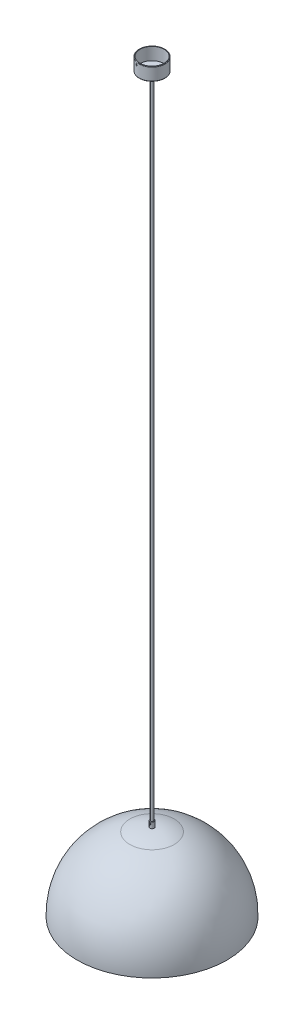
ISO-10303-21;
HEADER;
FILE_DESCRIPTION(('STEP AP214'),'2;1');
FILE_NAME('part.step','',(''),(''),'','','');
FILE_SCHEMA(('AUTOMOTIVE_DESIGN { 1 0 10303 214 1 1 1 1 }'));
ENDSEC;
DATA;
#1=APPLICATION_CONTEXT('core data for automotive mechanical design processes');
#2=APPLICATION_PROTOCOL_DEFINITION('international standard','automotive_design',2000,#1);
#3=PRODUCT_CONTEXT('',#1,'mechanical');
#4=PRODUCT('Part','Part','',(#3));
#5=PRODUCT_RELATED_PRODUCT_CATEGORY('part','',(#4));
#6=PRODUCT_DEFINITION_FORMATION('','',#4);
#7=PRODUCT_DEFINITION_CONTEXT('part definition',#1,'design');
#8=PRODUCT_DEFINITION('design','',#6,#7);
#9=PRODUCT_DEFINITION_SHAPE('','',#8);
#10=(LENGTH_UNIT() NAMED_UNIT(*) SI_UNIT(.MILLI.,.METRE.));
#11=(NAMED_UNIT(*) PLANE_ANGLE_UNIT() SI_UNIT($,.RADIAN.));
#12=(NAMED_UNIT(*) SI_UNIT($,.STERADIAN.) SOLID_ANGLE_UNIT());
#13=UNCERTAINTY_MEASURE_WITH_UNIT(LENGTH_MEASURE(1.E-05),#10,'distance_accuracy_value','');
#14=(GEOMETRIC_REPRESENTATION_CONTEXT(3) GLOBAL_UNCERTAINTY_ASSIGNED_CONTEXT((#13)) GLOBAL_UNIT_ASSIGNED_CONTEXT((#10,
#11,#12)) REPRESENTATION_CONTEXT('',''));
#15=CARTESIAN_POINT('',(0.,0.,0.));
#16=DIRECTION('',(0.,0.,1.));
#17=DIRECTION('',(1.,0.,0.));
#18=AXIS2_PLACEMENT_3D('',#15,#16,#17);
#19=CARTESIAN_POINT('',(-1.70945543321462,1578.98089947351,350.138888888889));
#20=DIRECTION('',(0.,1.,0.));
#21=DIRECTION('',(0.254766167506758,0.,-0.967002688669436));
#22=AXIS2_PLACEMENT_3D('',#19,#20,#21);
#23=CYLINDRICAL_SURFACE('',#22,5.);
#24=CARTESIAN_POINT('',(-1.70945543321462,1578.98089947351,350.138888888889));
#25=DIRECTION('',(0.,-1.,0.));
#26=DIRECTION('',(-0.254766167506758,0.,0.967002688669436));
#27=AXIS2_PLACEMENT_3D('',#24,#25,#26);
#28=CIRCLE('',#27,5.);
#29=CARTESIAN_POINT('',(-2.98328627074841,1578.98089947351,354.973902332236));
#30=VERTEX_POINT('',#29);
#31=EDGE_CURVE('P0_E21',#30,#30,#28,.T.);
#32=ORIENTED_EDGE('',*,*,#31,.F.);
#33=EDGE_LOOP('',(#32));
#34=FACE_BOUND('',#33,.T.);
#35=CARTESIAN_POINT('',(-1.70945543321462,1593.98089947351,350.138888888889));
#36=DIRECTION('',(0.,-1.,0.));
#37=DIRECTION('',(-0.254766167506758,0.,0.967002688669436));
#38=AXIS2_PLACEMENT_3D('',#35,#36,#37);
#39=CIRCLE('',#38,5.);
#40=CARTESIAN_POINT('',(-2.98328627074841,1593.98089947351,354.973902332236));
#41=VERTEX_POINT('',#40);
#42=EDGE_CURVE('P0_E17',#41,#41,#39,.T.);
#43=ORIENTED_EDGE('',*,*,#42,.T.);
#44=EDGE_LOOP('',(#43));
#45=FACE_BOUND('',#44,.T.);
#46=ADVANCED_FACE('P0_F14',(#34,#45),#23,.T.);
#47=CARTESIAN_POINT('',(-1.70945543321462,1578.98089947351,350.138888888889));
#48=DIRECTION('',(0.,-1.,0.));
#49=DIRECTION('',(-0.254766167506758,0.,0.967002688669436));
#50=AXIS2_PLACEMENT_3D('',#47,#48,#49);
#51=PLANE('',#50);
#52=CARTESIAN_POINT('',(-1.70945543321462,1578.98089947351,350.138888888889));
#53=DIRECTION('',(0.,-1.,0.));
#54=DIRECTION('',(-0.254766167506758,0.,0.967002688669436));
#55=AXIS2_PLACEMENT_3D('',#52,#53,#54);
#56=CIRCLE('',#55,3.);
#57=CARTESIAN_POINT('',(-2.4737539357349,1578.98089947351,353.039896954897));
#58=VERTEX_POINT('',#57);
#59=EDGE_CURVE('P0_E9',#58,#58,#56,.T.);
#60=ORIENTED_EDGE('',*,*,#59,.F.);
#61=EDGE_LOOP('',(#60));
#62=FACE_BOUND('',#61,.T.);
#63=ORIENTED_EDGE('',*,*,#31,.T.);
#64=EDGE_LOOP('',(#63));
#65=FACE_BOUND('',#64,.T.);
#66=ADVANCED_FACE('P0_F38',(#62,#65),#51,.T.);
#67=CARTESIAN_POINT('',(-1.70945543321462,1593.98089947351,350.138888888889));
#68=DIRECTION('',(0.,-1.,0.));
#69=DIRECTION('',(-0.254766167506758,0.,0.967002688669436));
#70=AXIS2_PLACEMENT_3D('',#67,#68,#69);
#71=PLANE('',#70);
#72=ORIENTED_EDGE('',*,*,#42,.F.);
#73=EDGE_LOOP('',(#72));
#74=FACE_BOUND('',#73,.T.);
#75=ADVANCED_FACE('P0_F35',(#74),#71,.F.);
#76=CARTESIAN_POINT('',(-1.70945543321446,78.9808994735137,350.138888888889));
#77=DIRECTION('',(0.,1.,0.));
#78=DIRECTION('',(0.254766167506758,0.,-0.967002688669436));
#79=AXIS2_PLACEMENT_3D('',#76,#77,#78);
#80=CYLINDRICAL_SURFACE('',#79,3.);
#81=CARTESIAN_POINT('',(-1.70945543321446,78.9808994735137,350.138888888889));
#82=DIRECTION('',(0.,-1.,0.));
#83=DIRECTION('',(-0.254766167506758,0.,0.967002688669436));
#84=AXIS2_PLACEMENT_3D('',#81,#82,#83);
#85=CIRCLE('',#84,3.);
#86=CARTESIAN_POINT('',(-2.47375393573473,78.9808994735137,353.039896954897));
#87=VERTEX_POINT('',#86);
#88=EDGE_CURVE('P0_E27',#87,#87,#85,.T.);
#89=ORIENTED_EDGE('',*,*,#88,.F.);
#90=EDGE_LOOP('',(#89));
#91=FACE_BOUND('',#90,.T.);
#92=ORIENTED_EDGE('',*,*,#59,.T.);
#93=EDGE_LOOP('',(#92));
#94=FACE_BOUND('',#93,.T.);
#95=ADVANCED_FACE('P0_F37',(#91,#94),#80,.T.);
#96=CARTESIAN_POINT('',(-1.70945543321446,78.9808994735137,350.138888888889));
#97=DIRECTION('',(0.,-1.,0.));
#98=DIRECTION('',(-0.254766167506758,0.,0.967002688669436));
#99=AXIS2_PLACEMENT_3D('',#96,#97,#98);
#100=PLANE('',#99);
#101=ORIENTED_EDGE('',*,*,#88,.T.);
#102=EDGE_LOOP('',(#101));
#103=FACE_BOUND('',#102,.T.);
#104=ADVANCED_FACE('P0_F44',(#103),#100,.T.);
#105=CLOSED_SHELL('',(#46,#66,#75,#95,#104));
#106=MANIFOLD_SOLID_BREP('P0_B1',#105);
#107=CARTESIAN_POINT('',(5.93352959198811,1617.19767740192,321.128808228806));
#108=DIRECTION('',(-0.254766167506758,0.,0.967002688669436));
#109=DIRECTION('',(-0.967002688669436,0.,-0.254766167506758));
#110=AXIS2_PLACEMENT_3D('',#107,#108,#109);
#111=CONICAL_SURFACE('',#110,2.16156164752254,0.767944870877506);
#112=CARTESIAN_POINT('',(5.98312195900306,1617.19767740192,320.9405730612));
#113=DIRECTION('',(0.254766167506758,0.,-0.967002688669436));
#114=DIRECTION('',(0.967002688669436,0.,0.254766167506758));
#115=AXIS2_PLACEMENT_3D('',#112,#113,#114);
#116=CIRCLE('',#115,1.97358224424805);
#117=CARTESIAN_POINT('',(4.07466262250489,1617.19767740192,320.437771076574));
#118=VERTEX_POINT('',#117);
#119=EDGE_CURVE('P1_E10',#118,#118,#116,.T.);
#120=CARTESIAN_POINT('',(5.93352959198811,1617.19767740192,321.128808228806));
#121=DIRECTION('',(-0.254766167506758,0.,0.967002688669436));
#122=DIRECTION('',(-0.967002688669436,0.,-0.254766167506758));
#123=AXIS2_PLACEMENT_3D('',#120,#121,#122);
#124=CIRCLE('',#123,2.16156164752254);
#125=CARTESIAN_POINT('',(3.84329366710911,1617.19767740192,320.578115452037));
#126=VERTEX_POINT('',#125);
#127=EDGE_CURVE('P1_E26',#126,#126,#124,.T.);
#128=CARTESIAN_POINT('',(4.07466262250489,1617.19767740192,320.437771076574));
#129=CARTESIAN_POINT('',(4.07225252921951,1617.19767740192,320.439232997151));
#130=CARTESIAN_POINT('',(4.06984243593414,1617.19767740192,320.440694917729));
#131=CARTESIAN_POINT('',(4.0650222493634,1617.19767740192,320.443618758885));
#132=CARTESIAN_POINT('',(4.06261215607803,1617.19767740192,320.445080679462));
#133=CARTESIAN_POINT('',(4.05779196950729,1617.19767740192,320.448004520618));
#134=CARTESIAN_POINT('',(4.05538187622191,1617.19767740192,320.449466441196));
#135=CARTESIAN_POINT('',(4.05056168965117,1617.19767740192,320.452390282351));
#136=CARTESIAN_POINT('',(4.04815159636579,1617.19767740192,320.453852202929));
#137=CARTESIAN_POINT('',(4.04333140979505,1617.19767740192,320.456776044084));
#138=CARTESIAN_POINT('',(4.04092131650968,1617.19767740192,320.458237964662));
#139=CARTESIAN_POINT('',(4.03610112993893,1617.19767740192,320.461161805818));
#140=CARTESIAN_POINT('',(4.03369103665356,1617.19767740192,320.462623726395));
#141=CARTESIAN_POINT('',(4.02887085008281,1617.19767740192,320.465547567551));
#142=CARTESIAN_POINT('',(4.02646075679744,1617.19767740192,320.467009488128));
#143=CARTESIAN_POINT('',(4.02164057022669,1617.19767740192,320.469933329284));
#144=CARTESIAN_POINT('',(4.01923047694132,1617.19767740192,320.471395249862));
#145=CARTESIAN_POINT('',(4.01441029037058,1617.19767740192,320.474319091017));
#146=CARTESIAN_POINT('',(4.0120001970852,1617.19767740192,320.475781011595));
#147=CARTESIAN_POINT('',(4.00718001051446,1617.19767740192,320.47870485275));
#148=CARTESIAN_POINT('',(4.00476991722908,1617.19767740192,320.480166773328));
#149=CARTESIAN_POINT('',(3.99994973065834,1617.19767740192,320.483090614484));
#150=CARTESIAN_POINT('',(3.99753963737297,1617.19767740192,320.484552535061));
#151=CARTESIAN_POINT('',(3.99271945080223,1617.19767740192,320.487476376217));
#152=CARTESIAN_POINT('',(3.99030935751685,1617.19767740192,320.488938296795));
#153=CARTESIAN_POINT('',(3.9854891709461,1617.19767740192,320.49186213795));
#154=CARTESIAN_POINT('',(3.98307907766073,1617.19767740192,320.493324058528));
#155=CARTESIAN_POINT('',(3.97825889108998,1617.19767740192,320.496247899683));
#156=CARTESIAN_POINT('',(3.97584879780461,1617.19767740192,320.497709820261));
#157=CARTESIAN_POINT('',(3.97102861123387,1617.19767740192,320.500633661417));
#158=CARTESIAN_POINT('',(3.9686185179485,1617.19767740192,320.502095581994));
#159=CARTESIAN_POINT('',(3.96379833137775,1617.19767740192,320.50501942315));
#160=CARTESIAN_POINT('',(3.96138823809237,1617.19767740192,320.506481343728));
#161=CARTESIAN_POINT('',(3.95656805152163,1617.19767740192,320.509405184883));
#162=CARTESIAN_POINT('',(3.95415795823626,1617.19767740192,320.510867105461));
#163=CARTESIAN_POINT('',(3.94933777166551,1617.19767740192,320.513790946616));
#164=CARTESIAN_POINT('',(3.94692767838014,1617.19767740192,320.515252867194));
#165=CARTESIAN_POINT('',(3.94210749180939,1617.19767740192,320.51817670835));
#166=CARTESIAN_POINT('',(3.93969739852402,1617.19767740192,320.519638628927));
#167=CARTESIAN_POINT('',(3.93487721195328,1617.19767740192,320.522562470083));
#168=CARTESIAN_POINT('',(3.9324671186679,1617.19767740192,320.52402439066));
#169=CARTESIAN_POINT('',(3.92764693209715,1617.19767740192,320.526948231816));
#170=CARTESIAN_POINT('',(3.92523683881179,1617.19767740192,320.528410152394));
#171=CARTESIAN_POINT('',(3.92041665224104,1617.19767740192,320.531333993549));
#172=CARTESIAN_POINT('',(3.91800655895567,1617.19767740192,320.532795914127));
#173=CARTESIAN_POINT('',(3.91318637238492,1617.19767740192,320.535719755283));
#174=CARTESIAN_POINT('',(3.91077627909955,1617.19767740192,320.53718167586));
#175=CARTESIAN_POINT('',(3.9059560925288,1617.19767740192,320.540105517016));
#176=CARTESIAN_POINT('',(3.90354599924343,1617.19767740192,320.541567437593));
#177=CARTESIAN_POINT('',(3.89872581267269,1617.19767740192,320.544491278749));
#178=CARTESIAN_POINT('',(3.89631571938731,1617.19767740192,320.545953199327));
#179=CARTESIAN_POINT('',(3.89149553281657,1617.19767740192,320.548877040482));
#180=CARTESIAN_POINT('',(3.88908543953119,1617.19767740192,320.55033896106));
#181=CARTESIAN_POINT('',(3.88426525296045,1617.19767740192,320.553262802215));
#182=CARTESIAN_POINT('',(3.88185515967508,1617.19767740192,320.554724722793));
#183=CARTESIAN_POINT('',(3.87703497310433,1617.19767740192,320.557648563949));
#184=CARTESIAN_POINT('',(3.87462487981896,1617.19767740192,320.559110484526));
#185=CARTESIAN_POINT('',(3.86980469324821,1617.19767740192,320.562034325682));
#186=CARTESIAN_POINT('',(3.86739459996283,1617.19767740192,320.56349624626));
#187=CARTESIAN_POINT('',(3.86257441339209,1617.19767740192,320.566420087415));
#188=CARTESIAN_POINT('',(3.86016432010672,1617.19767740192,320.567882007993));
#189=CARTESIAN_POINT('',(3.85534413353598,1617.19767740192,320.570805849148));
#190=CARTESIAN_POINT('',(3.85293404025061,1617.19767740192,320.572267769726));
#191=CARTESIAN_POINT('',(3.84811385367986,1617.19767740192,320.575191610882));
#192=CARTESIAN_POINT('',(3.84570376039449,1617.19767740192,320.576653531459));
#193=CARTESIAN_POINT('',(3.84329366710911,1617.19767740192,320.578115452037));
#194=B_SPLINE_CURVE_WITH_KNOTS('',3,(#128,#129,#130,#131,#132,#133,#134,#135,#136,#137,#138,
#139,#140,#141,#142,#143,#144,#145,#146,#147,#148,#149,#150,#151,#152,#153,#154,#155,#156,#157,
#158,#159,#160,#161,#162,#163,#164,#165,#166,#167,#168,#169,#170,#171,#172,#173,#174,#175,#176,
#177,#178,#179,#180,#181,#182,#183,#184,#185,#186,#187,#188,#189,#190,#191,#192,#193),
.UNSPECIFIED.,.F.,.F.,(4,2,2,2,2,2,2,2,2,2,2,2,2,2,2,2,2,2,2,2,2,2,2,2,2,2,2,2,2,2,2,2,4),(0.,
0.00845646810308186,0.0169129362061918,0.0253694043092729,0.0338258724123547,0.0422823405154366,
0.050738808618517,0.0591952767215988,0.0676517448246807,0.076108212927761,0.0845646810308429,
0.0930211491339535,0.101477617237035,0.109934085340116,0.118390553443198,0.126847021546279,
0.135303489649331,0.143759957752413,0.152216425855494,0.160672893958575,0.169129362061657,
0.177585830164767,0.186042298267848,0.19449876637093,0.202955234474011,0.211411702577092,
0.219868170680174,0.228324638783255,0.236781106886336,0.245237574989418,0.253694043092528,
0.262150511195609,0.270606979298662),.UNSPECIFIED.);
#195=EDGE_CURVE('P1_BSEAM15',#118,#126,#194,.T.);
#196=ORIENTED_EDGE('',*,*,#119,.F.);
#197=ORIENTED_EDGE('',*,*,#127,.F.);
#198=ORIENTED_EDGE('',*,*,#195,.T.);
#199=ORIENTED_EDGE('',*,*,#195,.F.);
#200=EDGE_LOOP('',(#196,#198,#197,#199));
#201=FACE_BOUND('',#200,.T.);
#202=ADVANCED_FACE('P1_F15',(#201),#111,.T.);
#203=CARTESIAN_POINT('',(6.06091267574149,1617.19767740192,320.645306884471));
#204=DIRECTION('',(0.254766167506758,0.,-0.967002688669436));
#205=DIRECTION('',(-0.967002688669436,0.,-0.254766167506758));
#206=AXIS2_PLACEMENT_3D('',#203,#204,#205);
#207=PLANE('',#206);
#208=CARTESIAN_POINT('',(6.06091267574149,1617.19767740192,320.645306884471));
#209=DIRECTION('',(-0.254766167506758,0.,0.967002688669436));
#210=DIRECTION('',(-0.967002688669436,0.,-0.254766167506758));
#211=AXIS2_PLACEMENT_3D('',#208,#209,#210);
#212=CIRCLE('',#211,1.2542424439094);
#213=CARTESIAN_POINT('',(4.84805686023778,1617.19767740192,320.325768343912));
#214=VERTEX_POINT('',#213);
#215=EDGE_CURVE('P1_E22',#214,#214,#212,.T.);
#216=ORIENTED_EDGE('',*,*,#215,.F.);
#217=EDGE_LOOP('',(#216));
#218=FACE_BOUND('',#217,.T.);
#219=ADVANCED_FACE('P1_F36',(#218),#207,.T.);
#220=CARTESIAN_POINT('',(5.93352959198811,1617.19767740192,321.128808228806));
#221=DIRECTION('',(0.254766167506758,0.,-0.967002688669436));
#222=DIRECTION('',(-0.967002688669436,0.,-0.254766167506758));
#223=AXIS2_PLACEMENT_3D('',#220,#221,#222);
#224=PLANE('',#223);
#225=ORIENTED_EDGE('',*,*,#127,.T.);
#226=EDGE_LOOP('',(#225));
#227=FACE_BOUND('',#226,.T.);
#228=ADVANCED_FACE('P1_F33',(#227),#224,.F.);
#229=CARTESIAN_POINT('',(5.80614650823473,1617.19767740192,321.612309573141));
#230=DIRECTION('',(0.254766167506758,0.,-0.967002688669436));
#231=DIRECTION('',(-0.967002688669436,0.,-0.254766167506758));
#232=AXIS2_PLACEMENT_3D('',#229,#230,#231);
#233=TOROIDAL_SURFACE('',#232,1.2542424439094,1.);
#234=ORIENTED_EDGE('',*,*,#119,.T.);
#235=EDGE_LOOP('',(#234));
#236=FACE_BOUND('',#235,.T.);
#237=ORIENTED_EDGE('',*,*,#215,.T.);
#238=EDGE_LOOP('',(#237));
#239=FACE_BOUND('',#238,.T.);
#240=ADVANCED_FACE('P1_F17',(#236,#239),#233,.T.);
#241=CLOSED_SHELL('',(#202,#219,#228,#240));
#242=MANIFOLD_SOLID_BREP('P1_B1',#241);
#243=CARTESIAN_POINT('',(-9.35244045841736,1617.19767740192,379.148969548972));
#244=DIRECTION('',(0.254766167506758,0.,-0.967002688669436));
#245=DIRECTION('',(-0.967002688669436,0.,-0.254766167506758));
#246=AXIS2_PLACEMENT_3D('',#243,#244,#245);
#247=CONICAL_SURFACE('',#246,2.16156164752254,0.767944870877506);
#248=CARTESIAN_POINT('',(-9.40203282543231,1617.19767740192,379.337204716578));
#249=DIRECTION('',(0.254766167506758,0.,-0.967002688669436));
#250=DIRECTION('',(0.967002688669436,0.,0.254766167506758));
#251=AXIS2_PLACEMENT_3D('',#248,#249,#250);
#252=CIRCLE('',#251,1.97358224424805);
#253=CARTESIAN_POINT('',(-11.3104921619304,1617.19767740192,378.834402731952));
#254=VERTEX_POINT('',#253);
#255=EDGE_CURVE('P2_E10',#254,#254,#252,.T.);
#256=CARTESIAN_POINT('',(-9.35244045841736,1617.19767740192,379.148969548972));
#257=DIRECTION('',(-0.254766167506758,0.,0.967002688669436));
#258=DIRECTION('',(-0.967002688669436,0.,-0.254766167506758));
#259=AXIS2_PLACEMENT_3D('',#256,#257,#258);
#260=CIRCLE('',#259,2.16156164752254);
#261=CARTESIAN_POINT('',(-11.4426763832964,1617.19767740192,378.598276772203));
#262=VERTEX_POINT('',#261);
#263=EDGE_CURVE('P2_E26',#262,#262,#260,.T.);
#264=CARTESIAN_POINT('',(-11.3104921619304,1617.19767740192,378.834402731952));
#265=CARTESIAN_POINT('',(-11.311869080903,1617.19767740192,378.831943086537));
#266=CARTESIAN_POINT('',(-11.3132459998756,1617.19767740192,378.829483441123));
#267=CARTESIAN_POINT('',(-11.3159998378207,1617.19767740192,378.824564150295));
#268=CARTESIAN_POINT('',(-11.3173767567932,1617.19767740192,378.822104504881));
#269=CARTESIAN_POINT('',(-11.3201305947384,1617.19767740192,378.817185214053));
#270=CARTESIAN_POINT('',(-11.3215075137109,1617.19767740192,378.814725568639));
#271=CARTESIAN_POINT('',(-11.3242613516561,1617.19767740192,378.809806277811));
#272=CARTESIAN_POINT('',(-11.3256382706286,1617.19767740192,378.807346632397));
#273=CARTESIAN_POINT('',(-11.3283921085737,1617.19767740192,378.802427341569));
#274=CARTESIAN_POINT('',(-11.3297690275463,1617.19767740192,378.799967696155));
#275=CARTESIAN_POINT('',(-11.3325228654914,1617.19767740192,378.795048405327));
#276=CARTESIAN_POINT('',(-11.333899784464,1617.19767740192,378.792588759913));
#277=CARTESIAN_POINT('',(-11.3366536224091,1617.19767740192,378.787669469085));
#278=CARTESIAN_POINT('',(-11.3380305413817,1617.19767740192,378.785209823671));
#279=CARTESIAN_POINT('',(-11.3407843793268,1617.19767740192,378.780290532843));
#280=CARTESIAN_POINT('',(-11.3421612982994,1617.19767740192,378.777830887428));
#281=CARTESIAN_POINT('',(-11.3449151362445,1617.19767740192,378.7729115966));
#282=CARTESIAN_POINT('',(-11.3462920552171,1617.19767740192,378.770451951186));
#283=CARTESIAN_POINT('',(-11.3490458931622,1617.19767740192,378.765532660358));
#284=CARTESIAN_POINT('',(-11.3504228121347,1617.19767740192,378.763073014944));
#285=CARTESIAN_POINT('',(-11.3531766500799,1617.19767740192,378.758153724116));
#286=CARTESIAN_POINT('',(-11.3545535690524,1617.19767740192,378.755694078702));
#287=CARTESIAN_POINT('',(-11.3573074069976,1617.19767740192,378.750774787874));
#288=CARTESIAN_POINT('',(-11.3586843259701,1617.19767740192,378.74831514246));
#289=CARTESIAN_POINT('',(-11.3614381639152,1617.19767740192,378.743395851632));
#290=CARTESIAN_POINT('',(-11.3628150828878,1617.19767740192,378.740936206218));
#291=CARTESIAN_POINT('',(-11.3655689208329,1617.19767740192,378.73601691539));
#292=CARTESIAN_POINT('',(-11.3669458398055,1617.19767740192,378.733557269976));
#293=CARTESIAN_POINT('',(-11.3696996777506,1617.19767740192,378.728637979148));
#294=CARTESIAN_POINT('',(-11.3710765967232,1617.19767740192,378.726178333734));
#295=CARTESIAN_POINT('',(-11.3738304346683,1617.19767740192,378.721259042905));
#296=CARTESIAN_POINT('',(-11.3752073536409,1617.19767740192,378.718799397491));
#297=CARTESIAN_POINT('',(-11.377961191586,1617.19767740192,378.713880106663));
#298=CARTESIAN_POINT('',(-11.3793381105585,1617.19767740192,378.711420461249));
#299=CARTESIAN_POINT('',(-11.3820919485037,1617.19767740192,378.706501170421));
#300=CARTESIAN_POINT('',(-11.3834688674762,1617.19767740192,378.704041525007));
#301=CARTESIAN_POINT('',(-11.3862227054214,1617.19767740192,378.699122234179));
#302=CARTESIAN_POINT('',(-11.3875996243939,1617.19767740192,378.696662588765));
#303=CARTESIAN_POINT('',(-11.390353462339,1617.19767740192,378.691743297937));
#304=CARTESIAN_POINT('',(-11.3917303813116,1617.19767740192,378.689283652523));
#305=CARTESIAN_POINT('',(-11.3944842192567,1617.19767740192,378.684364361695));
#306=CARTESIAN_POINT('',(-11.3958611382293,1617.19767740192,378.681904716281));
#307=CARTESIAN_POINT('',(-11.3986149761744,1617.19767740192,378.676985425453));
#308=CARTESIAN_POINT('',(-11.399991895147,1617.19767740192,378.674525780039));
#309=CARTESIAN_POINT('',(-11.4027457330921,1617.19767740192,378.66960648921));
#310=CARTESIAN_POINT('',(-11.4041226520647,1617.19767740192,378.667146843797));
#311=CARTESIAN_POINT('',(-11.4068764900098,1617.19767740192,378.662227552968));
#312=CARTESIAN_POINT('',(-11.4082534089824,1617.19767740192,378.659767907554));
#313=CARTESIAN_POINT('',(-11.4110072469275,1617.19767740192,378.654848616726));
#314=CARTESIAN_POINT('',(-11.4123841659,1617.19767740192,378.652388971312));
#315=CARTESIAN_POINT('',(-11.4151380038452,1617.19767740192,378.647469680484));
#316=CARTESIAN_POINT('',(-11.4165149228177,1617.19767740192,378.64501003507));
#317=CARTESIAN_POINT('',(-11.4192687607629,1617.19767740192,378.640090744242));
#318=CARTESIAN_POINT('',(-11.4206456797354,1617.19767740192,378.637631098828));
#319=CARTESIAN_POINT('',(-11.4233995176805,1617.19767740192,378.632711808));
#320=CARTESIAN_POINT('',(-11.4247764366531,1617.19767740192,378.630252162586));
#321=CARTESIAN_POINT('',(-11.4275302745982,1617.19767740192,378.625332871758));
#322=CARTESIAN_POINT('',(-11.4289071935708,1617.19767740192,378.622873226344));
#323=CARTESIAN_POINT('',(-11.4316610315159,1617.19767740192,378.617953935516));
#324=CARTESIAN_POINT('',(-11.4330379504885,1617.19767740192,378.615494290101));
#325=CARTESIAN_POINT('',(-11.4357917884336,1617.19767740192,378.610574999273));
#326=CARTESIAN_POINT('',(-11.4371687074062,1617.19767740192,378.608115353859));
#327=CARTESIAN_POINT('',(-11.4399225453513,1617.19767740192,378.603196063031));
#328=CARTESIAN_POINT('',(-11.4412994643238,1617.19767740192,378.600736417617));
#329=CARTESIAN_POINT('',(-11.4426763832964,1617.19767740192,378.598276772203));
#330=B_SPLINE_CURVE_WITH_KNOTS('',3,(#264,#265,#266,#267,#268,#269,#270,#271,#272,#273,#274,
#275,#276,#277,#278,#279,#280,#281,#282,#283,#284,#285,#286,#287,#288,#289,#290,#291,#292,#293,
#294,#295,#296,#297,#298,#299,#300,#301,#302,#303,#304,#305,#306,#307,#308,#309,#310,#311,#312,
#313,#314,#315,#316,#317,#318,#319,#320,#321,#322,#323,#324,#325,#326,#327,#328,#329),
.UNSPECIFIED.,.F.,.F.,(4,2,2,2,2,2,2,2,2,2,2,2,2,2,2,2,2,2,2,2,2,2,2,2,2,2,2,2,2,2,2,2,4),(0.,
0.00845646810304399,0.0169129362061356,0.025369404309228,0.0338258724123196,0.0422823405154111,
0.0507388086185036,0.0591952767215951,0.0676517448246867,0.0761082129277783,0.0845646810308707,
0.0930211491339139,0.101477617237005,0.109934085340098,0.118390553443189,0.126847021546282,
0.135303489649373,0.143759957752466,0.152216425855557,0.16067289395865,0.169129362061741,
0.177585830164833,0.186042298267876,0.194498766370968,0.20295523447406,0.211411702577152,
0.219868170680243,0.228324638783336,0.236781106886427,0.24523757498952,0.253694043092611,
0.262150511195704,0.270606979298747),.UNSPECIFIED.);
#331=EDGE_CURVE('P2_BSEAM15',#254,#262,#330,.T.);
#332=ORIENTED_EDGE('',*,*,#255,.T.);
#333=ORIENTED_EDGE('',*,*,#263,.T.);
#334=ORIENTED_EDGE('',*,*,#331,.T.);
#335=ORIENTED_EDGE('',*,*,#331,.F.);
#336=EDGE_LOOP('',(#332,#334,#333,#335));
#337=FACE_BOUND('',#336,.T.);
#338=ADVANCED_FACE('P2_F15',(#337),#247,.T.);
#339=CARTESIAN_POINT('',(-9.47982354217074,1617.19767740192,379.632470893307));
#340=DIRECTION('',(-0.254766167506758,0.,0.967002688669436));
#341=DIRECTION('',(-0.967002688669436,0.,-0.254766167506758));
#342=AXIS2_PLACEMENT_3D('',#339,#340,#341);
#343=PLANE('',#342);
#344=CARTESIAN_POINT('',(-9.47982354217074,1617.19767740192,379.632470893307));
#345=DIRECTION('',(-0.254766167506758,0.,0.967002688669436));
#346=DIRECTION('',(-0.967002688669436,0.,-0.254766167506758));
#347=AXIS2_PLACEMENT_3D('',#344,#345,#346);
#348=CIRCLE('',#347,1.2542424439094);
#349=CARTESIAN_POINT('',(-10.6926793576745,1617.19767740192,379.312932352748));
#350=VERTEX_POINT('',#349);
#351=EDGE_CURVE('P2_E22',#350,#350,#348,.T.);
#352=ORIENTED_EDGE('',*,*,#351,.T.);
#353=EDGE_LOOP('',(#352));
#354=FACE_BOUND('',#353,.T.);
#355=ADVANCED_FACE('P2_F36',(#354),#343,.T.);
#356=CARTESIAN_POINT('',(-9.35244045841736,1617.19767740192,379.148969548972));
#357=DIRECTION('',(-0.254766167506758,0.,0.967002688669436));
#358=DIRECTION('',(-0.967002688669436,0.,-0.254766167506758));
#359=AXIS2_PLACEMENT_3D('',#356,#357,#358);
#360=PLANE('',#359);
#361=ORIENTED_EDGE('',*,*,#263,.F.);
#362=EDGE_LOOP('',(#361));
#363=FACE_BOUND('',#362,.T.);
#364=ADVANCED_FACE('P2_F34',(#363),#360,.F.);
#365=CARTESIAN_POINT('',(-9.22505737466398,1617.19767740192,378.665468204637));
#366=DIRECTION('',(-0.254766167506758,0.,0.967002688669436));
#367=DIRECTION('',(-0.967002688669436,0.,-0.254766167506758));
#368=AXIS2_PLACEMENT_3D('',#365,#366,#367);
#369=TOROIDAL_SURFACE('',#368,1.2542424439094,1.);
#370=ORIENTED_EDGE('',*,*,#255,.F.);
#371=EDGE_LOOP('',(#370));
#372=FACE_BOUND('',#371,.T.);
#373=ORIENTED_EDGE('',*,*,#351,.F.);
#374=EDGE_LOOP('',(#373));
#375=FACE_BOUND('',#374,.T.);
#376=ADVANCED_FACE('P2_F17',(#372,#375),#369,.T.);
#377=CLOSED_SHELL('',(#338,#355,#364,#376));
#378=MANIFOLD_SOLID_BREP('P2_B1',#377);
#379=CARTESIAN_POINT('',(-1.70945543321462,1593.98089947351,350.138888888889));
#380=DIRECTION('',(0.,1.,0.));
#381=DIRECTION('',(0.254766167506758,0.,-0.967002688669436));
#382=AXIS2_PLACEMENT_3D('',#379,#380,#381);
#383=CYLINDRICAL_SURFACE('',#382,30.);
#384=CARTESIAN_POINT('',(-1.70945543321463,1622.98089947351,350.138888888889));
#385=DIRECTION('',(0.,-1.,0.));
#386=DIRECTION('',(-0.254766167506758,0.,0.967002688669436));
#387=AXIS2_PLACEMENT_3D('',#384,#385,#386);
#388=CIRCLE('',#387,30.);
#389=CARTESIAN_POINT('',(-9.35244045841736,1622.98089947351,379.148969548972));
#390=VERTEX_POINT('',#389);
#391=EDGE_CURVE('P3_E23',#390,#390,#388,.T.);
#392=ORIENTED_EDGE('',*,*,#391,.T.);
#393=EDGE_LOOP('',(#392));
#394=FACE_BOUND('',#393,.T.);
#395=CARTESIAN_POINT('',(-1.70945543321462,1594.98089947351,350.138888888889));
#396=DIRECTION('',(0.,-1.,0.));
#397=DIRECTION('',(-0.254766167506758,0.,0.967002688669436));
#398=AXIS2_PLACEMENT_3D('',#395,#396,#397);
#399=CIRCLE('',#398,30.);
#400=CARTESIAN_POINT('',(-9.35244045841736,1594.98089947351,379.148969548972));
#401=VERTEX_POINT('',#400);
#402=EDGE_CURVE('P3_E27',#401,#401,#399,.F.);
#403=ORIENTED_EDGE('',*,*,#402,.T.);
#404=EDGE_LOOP('',(#403));
#405=FACE_BOUND('',#404,.T.);
#406=ADVANCED_FACE('P3_F15',(#394,#405),#383,.T.);
#407=CARTESIAN_POINT('',(-1.70945543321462,1593.98089947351,350.138888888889));
#408=DIRECTION('',(0.,-1.,0.));
#409=DIRECTION('',(-0.254766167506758,0.,0.967002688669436));
#410=AXIS2_PLACEMENT_3D('',#407,#408,#409);
#411=PLANE('',#410);
#412=CARTESIAN_POINT('',(-1.70945543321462,1593.98089947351,350.138888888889));
#413=DIRECTION('',(0.,-1.,0.));
#414=DIRECTION('',(-0.254766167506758,0.,0.967002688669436));
#415=AXIS2_PLACEMENT_3D('',#412,#413,#414);
#416=CIRCLE('',#415,5.);
#417=CARTESIAN_POINT('',(-2.98328627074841,1593.98089947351,354.973902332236));
#418=VERTEX_POINT('',#417);
#419=EDGE_CURVE('P3_E41',#418,#418,#416,.T.);
#420=ORIENTED_EDGE('',*,*,#419,.F.);
#421=EDGE_LOOP('',(#420));
#422=FACE_BOUND('',#421,.T.);
#423=CARTESIAN_POINT('',(-1.70945543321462,1593.98089947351,350.138888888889));
#424=DIRECTION('',(0.,-1.,0.));
#425=DIRECTION('',(-0.254766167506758,0.,0.967002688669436));
#426=AXIS2_PLACEMENT_3D('',#423,#424,#425);
#427=CIRCLE('',#426,29.);
#428=CARTESIAN_POINT('',(-9.0976742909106,1593.98089947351,378.181966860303));
#429=VERTEX_POINT('',#428);
#430=EDGE_CURVE('P3_E32',#429,#429,#427,.T.);
#431=ORIENTED_EDGE('',*,*,#430,.T.);
#432=EDGE_LOOP('',(#431));
#433=FACE_BOUND('',#432,.T.);
#434=ADVANCED_FACE('P3_F65',(#422,#433),#411,.T.);
#435=CARTESIAN_POINT('',(-1.70945543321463,1623.98089947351,350.138888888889));
#436=DIRECTION('',(0.,-1.,0.));
#437=DIRECTION('',(-0.254766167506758,0.,0.967002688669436));
#438=AXIS2_PLACEMENT_3D('',#435,#436,#437);
#439=PLANE('',#438);
#440=CARTESIAN_POINT('',(-1.70945543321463,1623.98089947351,350.138888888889));
#441=DIRECTION('',(0.,1.,0.));
#442=DIRECTION('',(0.254766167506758,0.,-0.967002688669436));
#443=AXIS2_PLACEMENT_3D('',#440,#441,#442);
#444=CIRCLE('',#443,28.185970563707);
#445=CARTESIAN_POINT('',(5.47137626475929,1623.98089947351,322.882979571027));
#446=VERTEX_POINT('',#445);
#447=EDGE_CURVE('P3_E36',#446,#446,#444,.T.);
#448=ORIENTED_EDGE('',*,*,#447,.F.);
#449=EDGE_LOOP('',(#448));
#450=FACE_BOUND('',#449,.T.);
#451=CARTESIAN_POINT('',(-1.70945543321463,1623.98089947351,350.138888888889));
#452=DIRECTION('',(0.,-1.,0.));
#453=DIRECTION('',(-0.254766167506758,0.,0.967002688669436));
#454=AXIS2_PLACEMENT_3D('',#451,#452,#453);
#455=CIRCLE('',#454,29.);
#456=CARTESIAN_POINT('',(-9.09767429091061,1623.98089947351,378.181966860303));
#457=VERTEX_POINT('',#456);
#458=EDGE_CURVE('P3_E10',#457,#457,#455,.F.);
#459=ORIENTED_EDGE('',*,*,#458,.T.);
#460=EDGE_LOOP('',(#459));
#461=FACE_BOUND('',#460,.T.);
#462=ADVANCED_FACE('P3_F62',(#450,#461),#439,.F.);
#463=CARTESIAN_POINT('',(-1.70945543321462,1594.98089947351,350.138888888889));
#464=DIRECTION('',(0.,-1.,0.));
#465=DIRECTION('',(-0.254766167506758,0.,0.967002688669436));
#466=AXIS2_PLACEMENT_3D('',#463,#464,#465);
#467=TOROIDAL_SURFACE('',#466,29.,1.);
#468=ORIENTED_EDGE('',*,*,#402,.F.);
#469=EDGE_LOOP('',(#468));
#470=FACE_BOUND('',#469,.T.);
#471=ORIENTED_EDGE('',*,*,#430,.F.);
#472=EDGE_LOOP('',(#471));
#473=FACE_BOUND('',#472,.T.);
#474=ADVANCED_FACE('P3_F64',(#470,#473),#467,.T.);
#475=CARTESIAN_POINT('',(-1.70945543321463,1622.98089947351,350.138888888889));
#476=DIRECTION('',(0.,-1.,0.));
#477=DIRECTION('',(-0.254766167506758,0.,0.967002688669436));
#478=AXIS2_PLACEMENT_3D('',#475,#476,#477);
#479=TOROIDAL_SURFACE('',#478,29.,1.);
#480=ORIENTED_EDGE('',*,*,#458,.F.);
#481=EDGE_LOOP('',(#480));
#482=FACE_BOUND('',#481,.T.);
#483=ORIENTED_EDGE('',*,*,#391,.F.);
#484=EDGE_LOOP('',(#483));
#485=FACE_BOUND('',#484,.T.);
#486=ADVANCED_FACE('P3_F17',(#482,#485),#479,.T.);
#487=CARTESIAN_POINT('',(-1.70945543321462,1594.98089947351,350.138888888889));
#488=DIRECTION('',(0.,1.,0.));
#489=DIRECTION('',(0.254766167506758,0.,-0.967002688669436));
#490=AXIS2_PLACEMENT_3D('',#487,#488,#489);
#491=CYLINDRICAL_SURFACE('',#490,28.185970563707);
#492=CARTESIAN_POINT('',(-1.70945543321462,1594.98089947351,350.138888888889));
#493=DIRECTION('',(0.,1.,0.));
#494=DIRECTION('',(0.254766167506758,0.,-0.967002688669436));
#495=AXIS2_PLACEMENT_3D('',#492,#493,#494);
#496=CIRCLE('',#495,28.185970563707);
#497=CARTESIAN_POINT('',(5.4713762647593,1594.98089947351,322.882979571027));
#498=VERTEX_POINT('',#497);
#499=EDGE_CURVE('P3_E35',#498,#498,#496,.T.);
#500=CARTESIAN_POINT('',(5.4713762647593,1594.98089947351,322.882979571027));
#501=CARTESIAN_POINT('',(5.4713762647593,1595.28298280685,322.882979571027));
#502=CARTESIAN_POINT('',(5.4713762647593,1595.58506614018,322.882979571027));
#503=CARTESIAN_POINT('',(5.4713762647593,1596.18923280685,322.882979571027));
#504=CARTESIAN_POINT('',(5.4713762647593,1596.49131614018,322.882979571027));
#505=CARTESIAN_POINT('',(5.4713762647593,1597.09548280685,322.882979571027));
#506=CARTESIAN_POINT('',(5.4713762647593,1597.39756614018,322.882979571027));
#507=CARTESIAN_POINT('',(5.4713762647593,1598.00173280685,322.882979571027));
#508=CARTESIAN_POINT('',(5.4713762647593,1598.30381614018,322.882979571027));
#509=CARTESIAN_POINT('',(5.4713762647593,1598.90798280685,322.882979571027));
#510=CARTESIAN_POINT('',(5.4713762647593,1599.21006614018,322.882979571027));
#511=CARTESIAN_POINT('',(5.4713762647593,1599.81423280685,322.882979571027));
#512=CARTESIAN_POINT('',(5.4713762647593,1600.11631614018,322.882979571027));
#513=CARTESIAN_POINT('',(5.4713762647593,1600.72048280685,322.882979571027));
#514=CARTESIAN_POINT('',(5.4713762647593,1601.02256614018,322.882979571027));
#515=CARTESIAN_POINT('',(5.4713762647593,1601.62673280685,322.882979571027));
#516=CARTESIAN_POINT('',(5.4713762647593,1601.92881614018,322.882979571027));
#517=CARTESIAN_POINT('',(5.4713762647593,1602.53298280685,322.882979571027));
#518=CARTESIAN_POINT('',(5.4713762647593,1602.83506614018,322.882979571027));
#519=CARTESIAN_POINT('',(5.4713762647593,1603.43923280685,322.882979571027));
#520=CARTESIAN_POINT('',(5.4713762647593,1603.74131614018,322.882979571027));
#521=CARTESIAN_POINT('',(5.4713762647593,1604.34548280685,322.882979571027));
#522=CARTESIAN_POINT('',(5.4713762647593,1604.64756614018,322.882979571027));
#523=CARTESIAN_POINT('',(5.4713762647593,1605.25173280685,322.882979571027));
#524=CARTESIAN_POINT('',(5.4713762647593,1605.55381614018,322.882979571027));
#525=CARTESIAN_POINT('',(5.4713762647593,1606.15798280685,322.882979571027));
#526=CARTESIAN_POINT('',(5.4713762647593,1606.46006614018,322.882979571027));
#527=CARTESIAN_POINT('',(5.4713762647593,1607.06423280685,322.882979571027));
#528=CARTESIAN_POINT('',(5.4713762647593,1607.36631614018,322.882979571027));
#529=CARTESIAN_POINT('',(5.4713762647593,1607.97048280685,322.882979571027));
#530=CARTESIAN_POINT('',(5.4713762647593,1608.27256614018,322.882979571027));
#531=CARTESIAN_POINT('',(5.4713762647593,1608.87673280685,322.882979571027));
#532=CARTESIAN_POINT('',(5.4713762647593,1609.17881614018,322.882979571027));
#533=CARTESIAN_POINT('',(5.4713762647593,1609.78298280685,322.882979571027));
#534=CARTESIAN_POINT('',(5.4713762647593,1610.08506614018,322.882979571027));
#535=CARTESIAN_POINT('',(5.4713762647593,1610.68923280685,322.882979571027));
#536=CARTESIAN_POINT('',(5.4713762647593,1610.99131614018,322.882979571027));
#537=CARTESIAN_POINT('',(5.4713762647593,1611.59548280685,322.882979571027));
#538=CARTESIAN_POINT('',(5.4713762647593,1611.89756614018,322.882979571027));
#539=CARTESIAN_POINT('',(5.4713762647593,1612.50173280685,322.882979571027));
#540=CARTESIAN_POINT('',(5.4713762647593,1612.80381614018,322.882979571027));
#541=CARTESIAN_POINT('',(5.4713762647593,1613.40798280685,322.882979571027));
#542=CARTESIAN_POINT('',(5.4713762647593,1613.71006614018,322.882979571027));
#543=CARTESIAN_POINT('',(5.4713762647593,1614.31423280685,322.882979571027));
#544=CARTESIAN_POINT('',(5.4713762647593,1614.61631614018,322.882979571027));
#545=CARTESIAN_POINT('',(5.4713762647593,1615.22048280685,322.882979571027));
#546=CARTESIAN_POINT('',(5.4713762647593,1615.52256614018,322.882979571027));
#547=CARTESIAN_POINT('',(5.4713762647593,1616.12673280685,322.882979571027));
#548=CARTESIAN_POINT('',(5.4713762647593,1616.42881614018,322.882979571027));
#549=CARTESIAN_POINT('',(5.4713762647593,1617.03298280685,322.882979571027));
#550=CARTESIAN_POINT('',(5.4713762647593,1617.33506614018,322.882979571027));
#551=CARTESIAN_POINT('',(5.4713762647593,1617.93923280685,322.882979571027));
#552=CARTESIAN_POINT('',(5.4713762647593,1618.24131614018,322.882979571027));
#553=CARTESIAN_POINT('',(5.4713762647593,1618.84548280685,322.882979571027));
#554=CARTESIAN_POINT('',(5.4713762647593,1619.14756614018,322.882979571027));
#555=CARTESIAN_POINT('',(5.4713762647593,1619.75173280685,322.882979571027));
#556=CARTESIAN_POINT('',(5.4713762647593,1620.05381614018,322.882979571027));
#557=CARTESIAN_POINT('',(5.4713762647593,1620.65798280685,322.882979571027));
#558=CARTESIAN_POINT('',(5.4713762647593,1620.96006614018,322.882979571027));
#559=CARTESIAN_POINT('',(5.4713762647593,1621.56423280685,322.882979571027));
#560=CARTESIAN_POINT('',(5.4713762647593,1621.86631614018,322.882979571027));
#561=CARTESIAN_POINT('',(5.4713762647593,1622.47048280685,322.882979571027));
#562=CARTESIAN_POINT('',(5.47137626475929,1622.77256614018,322.882979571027));
#563=CARTESIAN_POINT('',(5.47137626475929,1623.37673280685,322.882979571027));
#564=CARTESIAN_POINT('',(5.47137626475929,1623.67881614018,322.882979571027));
#565=CARTESIAN_POINT('',(5.47137626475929,1623.98089947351,322.882979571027));
#566=B_SPLINE_CURVE_WITH_KNOTS('',3,(#500,#501,#502,#503,#504,#505,#506,#507,#508,#509,#510,
#511,#512,#513,#514,#515,#516,#517,#518,#519,#520,#521,#522,#523,#524,#525,#526,#527,#528,#529,
#530,#531,#532,#533,#534,#535,#536,#537,#538,#539,#540,#541,#542,#543,#544,#545,#546,#547,#548,
#549,#550,#551,#552,#553,#554,#555,#556,#557,#558,#559,#560,#561,#562,#563,#564,#565),
.UNSPECIFIED.,.F.,.F.,(4,2,2,2,2,2,2,2,2,2,2,2,2,2,2,2,2,2,2,2,2,2,2,2,2,2,2,2,2,2,2,2,4),(0.,
0.906250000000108,1.81249999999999,2.7187500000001,3.62499999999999,4.5312500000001,
5.43749999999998,6.34375000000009,7.24999999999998,8.15625000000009,9.06249999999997,
9.96875000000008,10.875,11.7812500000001,12.6875,13.5937500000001,14.5,15.4062500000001,16.3125,
17.2187500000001,18.1249999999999,19.0312500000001,19.9374999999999,20.84375,21.7499999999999,
22.65625,23.5624999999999,24.46875,25.3749999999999,26.28125,27.1874999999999,28.09375,
28.9999999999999),.UNSPECIFIED.);
#567=EDGE_CURVE('P3_BSEAM53',#498,#446,#566,.T.);
#568=ORIENTED_EDGE('',*,*,#499,.F.);
#569=ORIENTED_EDGE('',*,*,#447,.T.);
#570=ORIENTED_EDGE('',*,*,#567,.T.);
#571=ORIENTED_EDGE('',*,*,#567,.F.);
#572=EDGE_LOOP('',(#568,#570,#569,#571));
#573=FACE_BOUND('',#572,.T.);
#574=ADVANCED_FACE('P3_F53',(#573),#491,.F.);
#575=CARTESIAN_POINT('',(-1.70945543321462,1594.98089947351,350.138888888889));
#576=DIRECTION('',(0.,1.,0.));
#577=DIRECTION('',(0.254766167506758,0.,-0.967002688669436));
#578=AXIS2_PLACEMENT_3D('',#575,#576,#577);
#579=PLANE('',#578);
#580=CARTESIAN_POINT('',(-1.70945543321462,1594.98089947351,350.138888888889));
#581=DIRECTION('',(0.,1.,0.));
#582=DIRECTION('',(0.254766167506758,0.,-0.967002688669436));
#583=AXIS2_PLACEMENT_3D('',#580,#581,#582);
#584=CIRCLE('',#583,5.);
#585=CARTESIAN_POINT('',(-0.435624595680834,1594.98089947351,345.303875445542));
#586=VERTEX_POINT('',#585);
#587=EDGE_CURVE('P3_E19',#586,#586,#584,.T.);
#588=ORIENTED_EDGE('',*,*,#587,.F.);
#589=EDGE_LOOP('',(#588));
#590=FACE_BOUND('',#589,.T.);
#591=ORIENTED_EDGE('',*,*,#499,.T.);
#592=EDGE_LOOP('',(#591));
#593=FACE_BOUND('',#592,.T.);
#594=ADVANCED_FACE('P3_F50',(#590,#593),#579,.T.);
#595=CARTESIAN_POINT('',(-1.70945543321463,1632.98089947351,350.138888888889));
#596=DIRECTION('',(0.,-1.,0.));
#597=DIRECTION('',(-0.254766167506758,0.,0.967002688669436));
#598=AXIS2_PLACEMENT_3D('',#595,#596,#597);
#599=CYLINDRICAL_SURFACE('',#598,5.);
#600=ORIENTED_EDGE('',*,*,#587,.T.);
#601=EDGE_LOOP('',(#600));
#602=FACE_BOUND('',#601,.T.);
#603=ORIENTED_EDGE('',*,*,#419,.T.);
#604=EDGE_LOOP('',(#603));
#605=FACE_BOUND('',#604,.T.);
#606=ADVANCED_FACE('P3_F48',(#602,#605),#599,.F.);
#607=CLOSED_SHELL('',(#406,#434,#462,#474,#486,#574,#594,#606));
#608=MANIFOLD_SOLID_BREP('P3_B1',#607);
#609=CARTESIAN_POINT('',(-1.70945543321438,75.0268255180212,355.138888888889));
#610=DIRECTION('',(0.,0.,-1.));
#611=DIRECTION('',(1.,0.,0.));
#612=AXIS2_PLACEMENT_3D('',#609,#610,#611);
#613=CONICAL_SURFACE('',#612,2.16,0.767944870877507);
#614=CARTESIAN_POINT('',(-1.70945543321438,75.0268255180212,355.833547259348));
#615=DIRECTION('',(0.,0.,-1.));
#616=DIRECTION('',(-1.,0.,0.));
#617=AXIS2_PLACEMENT_3D('',#614,#615,#616);
#618=CIRCLE('',#617,1.48917620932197);
#619=CARTESIAN_POINT('',(-3.19863164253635,75.0268255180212,355.833547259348));
#620=VERTEX_POINT('',#619);
#621=EDGE_CURVE('P4_E10',#620,#620,#618,.T.);
#622=ORIENTED_EDGE('',*,*,#621,.T.);
#623=EDGE_LOOP('',(#622));
#624=FACE_BOUND('',#623,.T.);
#625=CARTESIAN_POINT('',(-1.70945543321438,75.0268255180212,355.138888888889));
#626=DIRECTION('',(0.,0.,1.));
#627=DIRECTION('',(1.,0.,0.));
#628=AXIS2_PLACEMENT_3D('',#625,#626,#627);
#629=CIRCLE('',#628,2.16);
#630=CARTESIAN_POINT('',(0.450544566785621,75.0268255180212,355.138888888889));
#631=VERTEX_POINT('',#630);
#632=EDGE_CURVE('P4_E26',#631,#631,#629,.T.);
#633=ORIENTED_EDGE('',*,*,#632,.T.);
#634=EDGE_LOOP('',(#633));
#635=FACE_BOUND('',#634,.T.);
#636=ADVANCED_FACE('P4_F15',(#624,#635),#613,.T.);
#637=CARTESIAN_POINT('',(-1.70945543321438,75.0268255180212,356.138888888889));
#638=DIRECTION('',(0.,0.,1.));
#639=DIRECTION('',(1.,0.,0.));
#640=AXIS2_PLACEMENT_3D('',#637,#638,#639);
#641=PLANE('',#640);
#642=CARTESIAN_POINT('',(-1.70945543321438,75.0268255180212,356.138888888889));
#643=DIRECTION('',(0.,0.,1.));
#644=DIRECTION('',(1.,0.,0.));
#645=AXIS2_PLACEMENT_3D('',#642,#643,#644);
#646=CIRCLE('',#645,0.76983640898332);
#647=CARTESIAN_POINT('',(-0.93961902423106,75.0268255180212,356.138888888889));
#648=VERTEX_POINT('',#647);
#649=EDGE_CURVE('P4_E22',#648,#648,#646,.T.);
#650=ORIENTED_EDGE('',*,*,#649,.T.);
#651=EDGE_LOOP('',(#650));
#652=FACE_BOUND('',#651,.T.);
#653=ADVANCED_FACE('P4_F36',(#652),#641,.T.);
#654=CARTESIAN_POINT('',(-1.70945543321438,75.0268255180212,355.138888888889));
#655=DIRECTION('',(0.,0.,1.));
#656=DIRECTION('',(1.,0.,0.));
#657=AXIS2_PLACEMENT_3D('',#654,#655,#656);
#658=PLANE('',#657);
#659=ORIENTED_EDGE('',*,*,#632,.F.);
#660=EDGE_LOOP('',(#659));
#661=FACE_BOUND('',#660,.T.);
#662=ADVANCED_FACE('P4_F34',(#661),#658,.F.);
#663=CARTESIAN_POINT('',(-1.70945543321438,75.0268255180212,355.138888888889));
#664=DIRECTION('',(0.,0.,1.));
#665=DIRECTION('',(1.,0.,0.));
#666=AXIS2_PLACEMENT_3D('',#663,#664,#665);
#667=DEGENERATE_TOROIDAL_SURFACE('',#666,0.76983640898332,1.,.T.);
#668=ORIENTED_EDGE('',*,*,#621,.F.);
#669=EDGE_LOOP('',(#668));
#670=FACE_BOUND('',#669,.T.);
#671=ORIENTED_EDGE('',*,*,#649,.F.);
#672=EDGE_LOOP('',(#671));
#673=FACE_BOUND('',#672,.T.);
#674=ADVANCED_FACE('P4_F17',(#670,#673),#667,.T.);
#675=CLOSED_SHELL('',(#636,#653,#662,#674));
#676=MANIFOLD_SOLID_BREP('P4_B1',#675);
#677=CARTESIAN_POINT('',(-1.70945543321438,-57.5148067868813,350.138888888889));
#678=DIRECTION('',(0.,-1.,0.));
#679=DIRECTION('',(0.,0.,-1.));
#680=AXIS2_PLACEMENT_3D('',#677,#678,#679);
#681=DEGENERATE_TOROIDAL_SURFACE('',#680,4.44202771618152,123.12764045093,.T.);
#682=CARTESIAN_POINT('',(-1.70945543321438,56.1451266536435,350.138888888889));
#683=DIRECTION('',(0.,-1.,0.));
#684=DIRECTION('',(0.,0.,-1.));
#685=AXIS2_PLACEMENT_3D('',#682,#683,#684);
#686=CIRCLE('',#685,51.7900516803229);
#687=CARTESIAN_POINT('',(50.0805962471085,56.1451266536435,350.138888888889));
#688=VERTEX_POINT('',#687);
#689=EDGE_CURVE('P5_E10',#688,#688,#686,.F.);
#690=ORIENTED_EDGE('',*,*,#689,.T.);
#691=EDGE_LOOP('',(#690));
#692=FACE_BOUND('',#691,.T.);
#693=CARTESIAN_POINT('',(-1.70945543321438,65.6115693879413,350.138888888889));
#694=DIRECTION('',(0.,-1.,0.));
#695=DIRECTION('',(0.,0.,-1.));
#696=AXIS2_PLACEMENT_3D('',#693,#694,#695);
#697=CIRCLE('',#696,5.);
#698=CARTESIAN_POINT('',(-1.70945543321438,65.6115693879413,345.138888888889));
#699=VERTEX_POINT('',#698);
#700=EDGE_CURVE('P5_E19',#699,#699,#697,.T.);
#701=ORIENTED_EDGE('',*,*,#700,.T.);
#702=EDGE_LOOP('',(#701));
#703=FACE_BOUND('',#702,.T.);
#704=ADVANCED_FACE('P5_F15',(#692,#703),#681,.T.);
#705=CARTESIAN_POINT('',(-1.70945543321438,-116.019100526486,350.138888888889));
#706=DIRECTION('',(0.,-1.,0.));
#707=DIRECTION('',(0.,0.,-1.));
#708=AXIS2_PLACEMENT_3D('',#705,#706,#707);
#709=PLANE('',#708);
#710=CARTESIAN_POINT('',(-1.70945543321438,-116.019100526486,350.138888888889));
#711=DIRECTION('',(0.,-1.,0.));
#712=DIRECTION('',(0.,0.,-1.));
#713=AXIS2_PLACEMENT_3D('',#710,#711,#712);
#714=CIRCLE('',#713,173.99960089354);
#715=CARTESIAN_POINT('',(172.290145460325,-116.019100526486,350.138888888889));
#716=VERTEX_POINT('',#715);
#717=EDGE_CURVE('P5_E27',#716,#716,#714,.T.);
#718=ORIENTED_EDGE('',*,*,#717,.F.);
#719=EDGE_LOOP('',(#718));
#720=FACE_BOUND('',#719,.T.);
#721=CARTESIAN_POINT('',(-1.70945543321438,-116.019100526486,350.138888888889));
#722=DIRECTION('',(0.,-1.,0.));
#723=DIRECTION('',(0.,0.,-1.));
#724=AXIS2_PLACEMENT_3D('',#721,#722,#723);
#725=CIRCLE('',#724,175.);
#726=CARTESIAN_POINT('',(173.290544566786,-116.019100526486,350.138888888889));
#727=VERTEX_POINT('',#726);
#728=EDGE_CURVE('P5_E23',#727,#727,#725,.T.);
#729=ORIENTED_EDGE('',*,*,#728,.T.);
#730=EDGE_LOOP('',(#729));
#731=FACE_BOUND('',#730,.T.);
#732=ADVANCED_FACE('P5_F17',(#720,#731),#709,.T.);
#733=CARTESIAN_POINT('',(-1.70945543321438,-111.088544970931,350.138888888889));
#734=DIRECTION('',(0.,-1.,0.));
#735=DIRECTION('',(1.,0.,0.));
#736=AXIS2_PLACEMENT_3D('',#733,#734,#735);
#737=SPHERICAL_SURFACE('',#736,175.069444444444);
#738=CARTESIAN_POINT('',(50.0805962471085,56.1451266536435,350.138888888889));
#739=CARTESIAN_POINT('',(51.2117267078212,55.7948324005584,350.138888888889));
#740=CARTESIAN_POINT('',(52.339302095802,55.4330587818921,350.138888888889));
#741=CARTESIAN_POINT('',(54.5868809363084,54.6867091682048,350.138888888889));
#742=CARTESIAN_POINT('',(55.706884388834,54.3021331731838,350.138888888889));
#743=CARTESIAN_POINT('',(57.9388575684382,53.510335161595,350.138888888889));
#744=CARTESIAN_POINT('',(59.0508272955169,53.1031131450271,350.138888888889));
#745=CARTESIAN_POINT('',(61.2662753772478,52.2661912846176,350.138888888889));
#746=CARTESIAN_POINT('',(62.3697537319,51.836491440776,350.138888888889));
#747=CARTESIAN_POINT('',(64.5677646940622,50.9547907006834,350.138888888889));
#748=CARTESIAN_POINT('',(65.6622973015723,50.5027898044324,350.138888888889));
#749=CARTESIAN_POINT('',(67.8419661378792,49.5766730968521,350.138888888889));
#750=CARTESIAN_POINT('',(68.927102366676,49.1025572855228,350.138888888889));
#751=CARTESIAN_POINT('',(71.0875316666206,48.1324059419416,350.138888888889));
#752=CARTESIAN_POINT('',(72.1628247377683,47.6363704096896,350.138888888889));
#753=CARTESIAN_POINT('',(74.303125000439,46.6225838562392,350.138888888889));
#754=CARTESIAN_POINT('',(75.3681321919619,46.1048328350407,350.138888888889));
#755=CARTESIAN_POINT('',(77.4874222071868,45.047828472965,350.138888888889));
#756=CARTESIAN_POINT('',(78.5417050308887,44.5085751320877,350.138888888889));
#757=CARTESIAN_POINT('',(80.6391122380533,43.4087881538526,350.138888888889));
#758=CARTESIAN_POINT('',(81.682236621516,42.8482545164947,350.138888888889));
#759=CARTESIAN_POINT('',(83.7568974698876,41.7061377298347,350.138888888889));
#760=CARTESIAN_POINT('',(84.7884339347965,41.1245545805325,350.138888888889));
#761=CARTESIAN_POINT('',(86.8394942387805,39.9405782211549,350.138888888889));
#762=CARTESIAN_POINT('',(87.8590180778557,39.3381850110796,350.138888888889));
#763=CARTESIAN_POINT('',(89.8856333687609,38.1128365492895,350.138888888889));
#764=CARTESIAN_POINT('',(90.8927248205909,37.4898812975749,350.138888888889));
#765=CARTESIAN_POINT('',(92.8940606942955,36.2236652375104,350.138888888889));
#766=CARTESIAN_POINT('',(93.8883051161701,35.5804044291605,350.138888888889));
#767=CARTESIAN_POINT('',(95.8635375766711,34.2738421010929,350.138888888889));
#768=CARTESIAN_POINT('',(96.8445256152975,33.6105405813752,350.138888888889));
#769=CARTESIAN_POINT('',(98.792841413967,32.2641699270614,350.138888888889));
#770=CARTESIAN_POINT('',(99.7601691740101,31.5811007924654,350.138888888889));
#771=CARTESIAN_POINT('',(101.680766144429,30.195476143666,350.138888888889));
#772=CARTESIAN_POINT('',(102.634035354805,29.4929206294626,350.138888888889));
#773=CARTESIAN_POINT('',(104.526122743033,28.0686124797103,350.138888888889));
#774=CARTESIAN_POINT('',(105.464940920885,27.3468598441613,350.138888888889));
#775=CARTESIAN_POINT('',(107.327739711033,25.8844546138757,350.138888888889));
#776=CARTESIAN_POINT('',(108.251720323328,25.1438020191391,350.138888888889));
#777=CARTESIAN_POINT('',(110.084463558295,23.6439018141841,350.138888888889));
#778=CARTESIAN_POINT('',(110.993226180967,22.8846542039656,350.138888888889));
#779=CARTESIAN_POINT('',(112.795159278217,21.3478765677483,350.138888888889));
#780=CARTESIAN_POINT('',(113.688329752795,20.5703465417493,350.138888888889));
#781=CARTESIAN_POINT('',(115.458710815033,18.9973242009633,350.138888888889));
#782=CARTESIAN_POINT('',(116.335921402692,18.2018318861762,350.138888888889));
#783=CARTESIAN_POINT('',(118.074021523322,16.5932124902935,350.138888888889));
#784=CARTESIAN_POINT('',(118.934911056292,15.780085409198,350.138888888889));
#785=CARTESIAN_POINT('',(120.640014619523,14.1365312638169,350.138888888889));
#786=CARTESIAN_POINT('',(121.484228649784,13.3061041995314,350.138888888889));
#787=CARTESIAN_POINT('',(123.155633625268,11.62829199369,350.138888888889));
#788=CARTESIAN_POINT('',(123.98282457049,10.780906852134,350.138888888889));
#789=CARTESIAN_POINT('',(125.619842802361,9.06952737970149,350.138888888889));
#790=CARTESIAN_POINT('',(126.42967008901,8.2055330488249,350.138888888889));
#791=CARTESIAN_POINT('',(128.031627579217,6.46129092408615,350.138888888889));
#792=CARTESIAN_POINT('',(128.823757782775,5.58104313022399,350.138888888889));
#793=CARTESIAN_POINT('',(130.389994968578,3.80465649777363,350.138888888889));
#794=CARTESIAN_POINT('',(131.164101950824,2.90851765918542,350.138888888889));
#795=CARTESIAN_POINT('',(132.693973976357,1.10071789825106,350.138888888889));
#796=CARTESIAN_POINT('',(133.449739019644,0.189056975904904,350.138888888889));
#797=CARTESIAN_POINT('',(134.942616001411,-1.64941160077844,350.138888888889));
#798=CARTESIAN_POINT('',(135.679727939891,-2.57621925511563,350.138888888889));
#799=CARTESIAN_POINT('',(137.134995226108,-4.44459970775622,350.138888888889));
#800=CARTESIAN_POINT('',(137.853150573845,-5.38617250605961,350.138888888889));
#801=CARTESIAN_POINT('',(139.270208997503,-7.28369557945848,350.138888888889));
#802=CARTESIAN_POINT('',(139.969112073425,-8.23964585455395,350.138888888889));
#803=CARTESIAN_POINT('',(141.347378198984,-10.165530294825,350.138888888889));
#804=CARTESIAN_POINT('',(142.026741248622,-11.1354644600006,350.138888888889));
#805=CARTESIAN_POINT('',(143.365647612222,-13.0889173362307,350.138888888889));
#806=CARTESIAN_POINT('',(144.025190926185,-14.0724360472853,350.138888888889));
#807=CARTESIAN_POINT('',(145.324186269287,-16.0526530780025,350.138888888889));
#808=CARTESIAN_POINT('',(145.963638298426,-17.049351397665,350.138888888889));
#809=CARTESIAN_POINT('',(147.222187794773,-19.0555172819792,350.138888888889));
#810=CARTESIAN_POINT('',(147.841285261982,-20.0649848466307,350.138888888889));
#811=CARTESIAN_POINT('',(149.058870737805,-22.096273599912,350.138888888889));
#812=CARTESIAN_POINT('',(149.657358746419,-23.1180947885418,350.138888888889));
#813=CARTESIAN_POINT('',(150.833478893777,-25.1736700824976,350.138888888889));
#814=CARTESIAN_POINT('',(151.411111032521,-26.2074241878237,350.138888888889));
#815=CARTESIAN_POINT('',(152.545281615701,-28.286439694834,350.138888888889));
#816=CARTESIAN_POINT('',(153.101820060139,-29.3317010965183,350.138888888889));
#817=CARTESIAN_POINT('',(154.193574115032,-31.4333008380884,350.138888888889));
#818=CARTESIAN_POINT('',(154.728789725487,-32.4896391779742,350.138888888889));
#819=CARTESIAN_POINT('',(155.77767775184,-34.6129578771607,350.138888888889));
#820=CARTESIAN_POINT('',(156.291350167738,-35.6799382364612,350.138888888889));
#821=CARTESIAN_POINT('',(157.296940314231,-37.8241016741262,350.138888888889));
#822=CARTESIAN_POINT('',(157.788858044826,-38.9012847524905,350.138888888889));
#823=CARTESIAN_POINT('',(158.750736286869,-41.065410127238,350.138888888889));
#824=CARTESIAN_POINT('',(159.220696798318,-42.152352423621,350.138888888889));
#825=CARTESIAN_POINT('',(160.13846710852,-44.3355487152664,350.138888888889));
#826=CARTESIAN_POINT('',(160.586276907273,-45.4318027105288,350.138888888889));
#827=CARTESIAN_POINT('',(161.459561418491,-47.6331710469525,350.138888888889));
#828=CARTESIAN_POINT('',(161.885036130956,-48.738285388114,350.138888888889));
#829=CARTESIAN_POINT('',(162.713475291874,-50.9569194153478,350.138888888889));
#830=CARTESIAN_POINT('',(163.116439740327,-52.0704391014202,350.138888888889));
#831=CARTESIAN_POINT('',(163.899692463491,-54.3054253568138,350.138888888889));
#832=CARTESIAN_POINT('',(164.279980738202,-55.426891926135,350.138888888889));
#833=CARTESIAN_POINT('',(165.017724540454,-57.6773102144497,350.138888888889));
#834=CARTESIAN_POINT('',(165.375180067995,-58.8062619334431,350.138888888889));
#835=CARTESIAN_POINT('',(166.067111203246,-61.0711857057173,350.138888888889));
#836=CARTESIAN_POINT('',(166.401586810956,-62.2071577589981,350.138888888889));
#837=CARTESIAN_POINT('',(167.047420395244,-64.4856544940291,350.138888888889));
#838=CARTESIAN_POINT('',(167.358778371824,-65.6281791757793,350.138888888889));
#839=CARTESIAN_POINT('',(167.958248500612,-67.9193107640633,350.138888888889));
#840=CARTESIAN_POINT('',(168.246360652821,-69.067917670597,350.138888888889));
#841=CARTESIAN_POINT('',(168.799220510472,-71.3707408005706,350.138888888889));
#842=CARTESIAN_POINT('',(169.063968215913,-72.5249570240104,350.138888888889));
#843=CARTESIAN_POINT('',(169.569990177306,-74.8385235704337,350.138888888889));
#844=CARTESIAN_POINT('',(169.811264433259,-75.9978738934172,350.138888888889));
#845=CARTESIAN_POINT('',(170.270240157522,-78.3212313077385,350.138888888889));
#846=CARTESIAN_POINT('',(170.487941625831,-79.4852383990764,350.138888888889));
#847=CARTESIAN_POINT('',(170.89968214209,-81.8174301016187,350.138888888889));
#848=CARTESIAN_POINT('',(171.09372119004,-82.9856147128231,350.138888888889));
#849=CARTESIAN_POINT('',(171.458056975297,-85.3256804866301,350.138888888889));
#850=CARTESIAN_POINT('',(171.628353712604,-86.4975616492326,350.138888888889));
#851=CARTESIAN_POINT('',(171.945134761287,-88.8445380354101,350.138888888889));
#852=CARTESIAN_POINT('',(172.091619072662,-90.0196332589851,350.138888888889));
#853=CARTESIAN_POINT('',(172.360714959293,-92.3725539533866,350.138888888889));
#854=CARTESIAN_POINT('',(172.483326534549,-93.5503794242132,350.138888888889));
#855=CARTESIAN_POINT('',(172.70462646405,-95.9082756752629,350.138888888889));
#856=CARTESIAN_POINT('',(172.803314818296,-97.088346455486,350.138888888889));
#857=CARTESIAN_POINT('',(172.976727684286,-99.4502474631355,350.138888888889));
#858=CARTESIAN_POINT('',(173.05145219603,-100.632077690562,350.138888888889));
#859=CARTESIAN_POINT('',(173.176906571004,-102.997011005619,350.138888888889));
#860=CARTESIAN_POINT('',(173.227636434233,-104.180114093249,350.138888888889));
#861=CARTESIAN_POINT('',(173.305080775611,-106.547106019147,350.138888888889));
#862=CARTESIAN_POINT('',(173.331795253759,-107.730994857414,350.138888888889));
#863=CARTESIAN_POINT('',(173.36119726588,-110.099070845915,350.138888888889));
#864=CARTESIAN_POINT('',(173.363884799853,-111.283257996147,350.138888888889));
#865=CARTESIAN_POINT('',(173.345233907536,-113.651443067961,350.138888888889));
#866=CARTESIAN_POINT('',(173.323895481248,-114.835440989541,350.138888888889));
#867=CARTESIAN_POINT('',(173.290544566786,-116.019100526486,350.138888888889));
#868=B_SPLINE_CURVE_WITH_KNOTS('',3,(#738,#739,#740,#741,#742,#743,#744,#745,#746,#747,#748,
#749,#750,#751,#752,#753,#754,#755,#756,#757,#758,#759,#760,#761,#762,#763,#764,#765,#766,#767,
#768,#769,#770,#771,#772,#773,#774,#775,#776,#777,#778,#779,#780,#781,#782,#783,#784,#785,#786,
#787,#788,#789,#790,#791,#792,#793,#794,#795,#796,#797,#798,#799,#800,#801,#802,#803,#804,#805,
#806,#807,#808,#809,#810,#811,#812,#813,#814,#815,#816,#817,#818,#819,#820,#821,#822,#823,#824,
#825,#826,#827,#828,#829,#830,#831,#832,#833,#834,#835,#836,#837,#838,#839,#840,#841,#842,#843,
#844,#845,#846,#847,#848,#849,#850,#851,#852,#853,#854,#855,#856,#857,#858,#859,#860,#861,#862,
#863,#864,#865,#866,#867),.UNSPECIFIED.,.F.,.F.,(4,2,2,2,2,2,2,2,2,2,2,2,2,2,2,2,2,2,2,2,2,2,2,
2,2,2,2,2,2,2,2,2,2,2,2,2,2,2,2,2,2,2,2,2,2,2,2,2,2,2,2,2,2,2,2,2,2,2,2,2,2,2,2,2,4),(0.,
3.55232683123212,7.10465366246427,10.6569804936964,14.2093073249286,17.7616341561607,
21.3139609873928,24.866287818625,28.4186146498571,31.9709414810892,35.5232683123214,
39.0755951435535,42.6279219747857,46.1802488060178,49.7325756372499,53.2849024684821,
56.8372292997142,60.3895561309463,63.9418829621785,67.4942097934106,71.0465366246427,
74.5988634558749,78.151190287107,81.7035171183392,85.2558439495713,88.8081707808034,
92.3604976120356,95.9128244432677,99.4651512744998,103.017478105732,106.569804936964,
110.122131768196,113.674458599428,117.226785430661,120.779112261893,124.331439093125,
127.883765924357,131.436092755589,134.988419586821,138.540746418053,142.093073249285,
145.645400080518,149.19772691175,152.750053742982,156.302380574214,159.854707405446,
163.407034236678,166.95936106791,170.511687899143,174.064014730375,177.616341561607,
181.168668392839,184.720995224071,188.273322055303,191.825648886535,195.377975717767,
198.930302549,202.482629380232,206.034956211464,209.587283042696,213.139609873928,
216.69193670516,220.244263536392,223.796590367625,227.348917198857),.UNSPECIFIED.);
#869=EDGE_CURVE('P5_BSEAM63',#688,#727,#868,.T.);
#870=ORIENTED_EDGE('',*,*,#689,.F.);
#871=ORIENTED_EDGE('',*,*,#728,.F.);
#872=ORIENTED_EDGE('',*,*,#869,.T.);
#873=ORIENTED_EDGE('',*,*,#869,.F.);
#874=EDGE_LOOP('',(#870,#872,#871,#873));
#875=FACE_BOUND('',#874,.T.);
#876=ADVANCED_FACE('P5_F63',(#875),#737,.T.);
#877=CARTESIAN_POINT('',(-1.70945543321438,-111.088544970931,350.138888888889));
#878=DIRECTION('',(0.,-1.,0.));
#879=DIRECTION('',(1.,0.,0.));
#880=AXIS2_PLACEMENT_3D('',#877,#878,#879);
#881=SPHERICAL_SURFACE('',#880,174.069444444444);
#882=CARTESIAN_POINT('',(-1.70945543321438,56.1451266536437,350.138888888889));
#883=DIRECTION('',(0.,-1.,0.));
#884=DIRECTION('',(0.,0.,-1.));
#885=AXIS2_PLACEMENT_3D('',#882,#883,#884);
#886=CIRCLE('',#885,48.3018691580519);
#887=CARTESIAN_POINT('',(46.5924137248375,56.1451266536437,350.138888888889));
#888=VERTEX_POINT('',#887);
#889=EDGE_CURVE('P5_E30',#888,#888,#886,.F.);
#890=CARTESIAN_POINT('',(46.5924137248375,56.1451266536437,350.138888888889));
#891=CARTESIAN_POINT('',(47.7403591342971,55.8135691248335,350.138888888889));
#892=CARTESIAN_POINT('',(48.8848895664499,55.4701882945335,350.138888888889));
#893=CARTESIAN_POINT('',(51.166637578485,54.7599335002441,350.138888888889));
#894=CARTESIAN_POINT('',(52.3038551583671,54.3930595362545,350.138888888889));
#895=CARTESIAN_POINT('',(54.5704945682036,53.6359719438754,350.138888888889));
#896=CARTESIAN_POINT('',(55.6999163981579,53.2457583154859,350.138888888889));
#897=CARTESIAN_POINT('',(57.9504855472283,52.4421574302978,350.138888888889));
#898=CARTESIAN_POINT('',(59.0716328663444,52.0287701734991,350.138888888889));
#899=CARTESIAN_POINT('',(61.305177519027,51.1789971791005,350.138888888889));
#900=CARTESIAN_POINT('',(62.4175748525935,50.7426114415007,350.138888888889));
#901=CARTESIAN_POINT('',(64.6331478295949,49.8470265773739,350.138888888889));
#902=CARTESIAN_POINT('',(65.7363234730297,49.387827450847,350.138888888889));
#903=CARTESIAN_POINT('',(67.9329852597,48.4468105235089,350.138888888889));
#904=CARTESIAN_POINT('',(69.0264714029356,47.9649927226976,350.138888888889));
#905=CARTESIAN_POINT('',(71.2032904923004,46.978942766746,350.138888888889));
#906=CARTESIAN_POINT('',(72.2866234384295,46.4747106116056,350.138888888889));
#907=CARTESIAN_POINT('',(74.4426767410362,45.4440457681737,350.138888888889));
#908=CARTESIAN_POINT('',(75.5153970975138,44.9176130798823,350.138888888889));
#909=CARTESIAN_POINT('',(77.649770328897,43.842770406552,350.138888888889));
#910=CARTESIAN_POINT('',(78.7114232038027,43.2943604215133,350.138888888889));
#911=CARTESIAN_POINT('',(80.8232112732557,42.175795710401,350.138888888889));
#912=CARTESIAN_POINT('',(81.8733464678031,41.6056409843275,350.138888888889));
#913=CARTESIAN_POINT('',(83.9616538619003,40.4438285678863,350.138888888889));
#914=CARTESIAN_POINT('',(84.9998260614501,39.8521708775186,350.138888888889));
#915=CARTESIAN_POINT('',(87.0637672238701,38.6476034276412,350.138888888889));
#916=CARTESIAN_POINT('',(88.0895361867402,38.0346936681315,350.138888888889));
#917=CARTESIAN_POINT('',(90.1282358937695,36.7878819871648,350.138888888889));
#918=CARTESIAN_POINT('',(91.1411666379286,36.1539800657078,350.138888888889));
#919=CARTESIAN_POINT('',(93.1537603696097,34.8654528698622,350.138888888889));
#920=CARTESIAN_POINT('',(94.1534233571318,34.2108275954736,350.138888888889));
#921=CARTESIAN_POINT('',(96.1390576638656,32.8811312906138,350.138888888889));
#922=CARTESIAN_POINT('',(97.1250289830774,32.2060602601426,350.138888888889));
#923=CARTESIAN_POINT('',(99.0828618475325,30.835758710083,350.138888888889));
#924=CARTESIAN_POINT('',(100.054723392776,30.1405281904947,350.138888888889));
#925=CARTESIAN_POINT('',(101.98392458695,28.7302024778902,350.138888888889));
#926=CARTESIAN_POINT('',(102.941264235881,28.015107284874,350.138888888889));
#927=CARTESIAN_POINT('',(104.841015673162,26.565355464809,350.138888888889));
#928=CARTESIAN_POINT('',(105.783427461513,25.8306988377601,350.138888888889));
#929=CARTESIAN_POINT('',(107.652923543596,24.3421356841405,350.138888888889));
#930=CARTESIAN_POINT('',(108.580007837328,23.5882291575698,350.138888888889));
#931=CARTESIAN_POINT('',(110.418455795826,22.0614859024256,350.138888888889));
#932=CARTESIAN_POINT('',(111.329819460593,21.2886491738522,350.138888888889));
#933=CARTESIAN_POINT('',(113.136439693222,19.7243732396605,350.138888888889));
#934=CARTESIAN_POINT('',(114.031696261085,18.9329340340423,350.138888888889));
#935=CARTESIAN_POINT('',(115.805722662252,17.3317887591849,350.138888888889));
#936=CARTESIAN_POINT('',(116.684492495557,16.5220826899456,350.138888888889));
#937=CARTESIAN_POINT('',(118.425172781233,14.8847470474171,350.138888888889));
#938=CARTESIAN_POINT('',(119.287083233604,14.0571174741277,350.138888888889));
#939=CARTESIAN_POINT('',(120.993679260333,12.3842857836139,350.138888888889));
#940=CARTESIAN_POINT('',(121.838364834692,11.5390836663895,350.138888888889));
#941=CARTESIAN_POINT('',(123.510152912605,9.83146529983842,350.138888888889));
#942=CARTESIAN_POINT('',(124.33725541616,8.96904905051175,350.138888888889));
#943=CARTESIAN_POINT('',(125.973526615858,7.22736813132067,350.138888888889));
#944=CARTESIAN_POINT('',(126.782695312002,6.34810346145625,350.138888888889));
#945=CARTESIAN_POINT('',(128.38275576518,4.57309855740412,350.138888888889));
#946=CARTESIAN_POINT('',(129.173647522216,3.6773583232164,350.138888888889));
#947=CARTESIAN_POINT('',(130.736818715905,1.86978213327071,350.138888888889));
#948=CARTESIAN_POINT('',(131.509098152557,0.957946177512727,350.138888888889));
#949=CARTESIAN_POINT('',(133.034717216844,-0.881434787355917,350.138888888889));
#950=CARTESIAN_POINT('',(133.788056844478,-1.80897979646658,350.138888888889));
#951=CARTESIAN_POINT('',(135.275476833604,-3.67938553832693,350.138888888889));
#952=CARTESIAN_POINT('',(136.009557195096,-4.62224627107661,350.138888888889));
#953=CARTESIAN_POINT('',(137.458147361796,-6.5228836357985,350.138888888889));
#954=CARTESIAN_POINT('',(138.172657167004,-7.4806602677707,350.138888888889));
#955=CARTESIAN_POINT('',(139.581803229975,-9.41072328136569,350.138888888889));
#956=CARTESIAN_POINT('',(140.276439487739,-10.3830096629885,350.138888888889));
#957=CARTESIAN_POINT('',(141.645543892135,-12.3416798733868,350.138888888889));
#958=CARTESIAN_POINT('',(142.320012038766,-13.3280637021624,350.138888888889));
#959=CARTESIAN_POINT('',(143.648494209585,-15.3145105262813,350.138888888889));
#960=CARTESIAN_POINT('',(144.302508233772,-16.3145735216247,350.138888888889));
#961=CARTESIAN_POINT('',(145.58980482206,-18.3279545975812,350.138888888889));
#962=CARTESIAN_POINT('',(146.223087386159,-19.3412726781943,350.138888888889));
#963=CARTESIAN_POINT('',(147.468652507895,-21.3807342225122,350.138888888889));
#964=CARTESIAN_POINT('',(148.080935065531,-22.4068776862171,350.138888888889));
#965=CARTESIAN_POINT('',(149.284240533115,-24.4715548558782,350.138888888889));
#966=CARTESIAN_POINT('',(149.875263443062,-25.5100885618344,350.138888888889));
#967=CARTESIAN_POINT('',(151.035798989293,-27.5991058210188,350.138888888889));
#968=CARTESIAN_POINT('',(151.605311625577,-28.649589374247,350.138888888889));
#969=CARTESIAN_POINT('',(152.722585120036,-30.7620608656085,350.138888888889));
#970=CARTESIAN_POINT('',(153.270345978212,-31.8240488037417,350.138888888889));
#971=CARTESIAN_POINT('',(154.343883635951,-33.9590787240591,350.138888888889));
#972=CARTESIAN_POINT('',(154.869660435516,-35.0321207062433,350.138888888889));
#973=CARTESIAN_POINT('',(155.899007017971,-37.1888036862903,350.138888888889));
#974=CARTESIAN_POINT('',(156.402576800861,-38.2724446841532,350.138888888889));
#975=CARTESIAN_POINT('',(157.387295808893,-40.4498661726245,350.138888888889));
#976=CARTESIAN_POINT('',(157.868445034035,-41.5436466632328,350.138888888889));
#977=CARTESIAN_POINT('',(158.808118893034,-43.7408833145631,350.138888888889));
#978=CARTESIAN_POINT('',(159.266643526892,-44.844339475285,350.138888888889));
#979=CARTESIAN_POINT('',(160.160873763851,-47.0604595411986,350.138888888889));
#980=CARTESIAN_POINT('',(160.596579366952,-48.1731234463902,350.138888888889));
#981=CARTESIAN_POINT('',(161.444986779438,-50.4071871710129,350.138888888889));
#982=CARTESIAN_POINT('',(161.857688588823,-51.5285869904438,350.138888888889));
#983=CARTESIAN_POINT('',(162.659913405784,-53.7796470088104,350.138888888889));
#984=CARTESIAN_POINT('',(163.049436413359,-54.909307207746,350.138888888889));
#985=CARTESIAN_POINT('',(163.805138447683,-57.1764089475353,350.138888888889));
#986=CARTESIAN_POINT('',(164.171317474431,-58.313850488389,350.138888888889));
#987=CARTESIAN_POINT('',(164.880176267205,-60.5960325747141,350.138888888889));
#988=CARTESIAN_POINT('',(165.22285603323,-61.7407731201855,350.138888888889));
#989=CARTESIAN_POINT('',(165.884570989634,-64.0370677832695,350.138888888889));
#990=CARTESIAN_POINT('',(166.203606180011,-65.1886219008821,350.138888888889));
#991=CARTESIAN_POINT('',(166.817896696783,-67.4980553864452,350.138888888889));
#992=CARTESIAN_POINT('',(167.113152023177,-68.6559347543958,350.138888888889));
#993=CARTESIAN_POINT('',(167.679757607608,-70.9775277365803,350.138888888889));
#994=CARTESIAN_POINT('',(167.951107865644,-72.1412413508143,350.138888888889));
#995=CARTESIAN_POINT('',(168.469788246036,-74.4740093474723,350.138888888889));
#996=CARTESIAN_POINT('',(168.717118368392,-75.6430637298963,350.138888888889));
#997=CARTESIAN_POINT('',(169.187653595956,-77.9860175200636,350.138888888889));
#998=CARTESIAN_POINT('',(169.410858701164,-79.1599169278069,350.138888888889));
#999=CARTESIAN_POINT('',(169.833049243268,-81.5120629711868,350.138888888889));
#1000=CARTESIAN_POINT('',(170.032034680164,-82.6903096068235,350.138888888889));
#1001=CARTESIAN_POINT('',(170.405701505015,-85.0506504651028,350.138888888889));
#1002=CARTESIAN_POINT('',(170.58038289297,-86.2327446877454,350.138888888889));
#1003=CARTESIAN_POINT('',(170.905367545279,-88.6002794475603,350.138888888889));
#1004=CARTESIAN_POINT('',(171.055670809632,-89.7857199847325,350.138888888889));
#1005=CARTESIAN_POINT('',(171.331835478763,-92.1594446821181,350.138888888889));
#1006=CARTESIAN_POINT('',(171.457696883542,-93.3477288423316,350.138888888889));
#1007=CARTESIAN_POINT('',(171.684924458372,-95.7266368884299,350.138888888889));
#1008=CARTESIAN_POINT('',(171.786290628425,-96.9172607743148,350.138888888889));
#1009=CARTESIAN_POINT('',(171.96448476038,-99.3003433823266,350.138888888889));
#1010=CARTESIAN_POINT('',(172.041312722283,-100.492802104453,350.138888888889));
#1011=CARTESIAN_POINT('',(172.170397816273,-102.879048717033,350.138888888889));
#1012=CARTESIAN_POINT('',(172.22265494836,-104.072836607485,350.138888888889));
#1013=CARTESIAN_POINT('',(172.302576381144,-106.461235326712,350.138888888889));
#1014=CARTESIAN_POINT('',(172.330240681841,-107.655846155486,350.138888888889));
#1015=CARTESIAN_POINT('',(172.360964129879,-110.045384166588,350.138888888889));
#1016=CARTESIAN_POINT('',(172.36402327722,-111.240311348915,350.138888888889));
#1017=CARTESIAN_POINT('',(172.345537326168,-113.629975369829,350.138888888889));
#1018=CARTESIAN_POINT('',(172.323992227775,-114.824712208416,350.138888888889));
#1019=CARTESIAN_POINT('',(172.290145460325,-116.019100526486,350.138888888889));
#1020=B_SPLINE_CURVE_WITH_KNOTS('',3,(#890,#891,#892,#893,#894,#895,#896,#897,#898,#899,#900,
#901,#902,#903,#904,#905,#906,#907,#908,#909,#910,#911,#912,#913,#914,#915,#916,#917,#918,#919,
#920,#921,#922,#923,#924,#925,#926,#927,#928,#929,#930,#931,#932,#933,#934,#935,#936,#937,#938,
#939,#940,#941,#942,#943,#944,#945,#946,#947,#948,#949,#950,#951,#952,#953,#954,#955,#956,#957,
#958,#959,#960,#961,#962,#963,#964,#965,#966,#967,#968,#969,#970,#971,#972,#973,#974,#975,#976,
#977,#978,#979,#980,#981,#982,#983,#984,#985,#986,#987,#988,#989,#990,#991,#992,#993,#994,#995,
#996,#997,#998,#999,#1000,#1001,#1002,#1003,#1004,#1005,#1006,#1007,#1008,#1009,#1010,#1011,
#1012,#1013,#1014,#1015,#1016,#1017,#1018,#1019),.UNSPECIFIED.,.F.,.F.,(4,2,2,2,2,2,2,2,2,2,2,2,
2,2,2,2,2,2,2,2,2,2,2,2,2,2,2,2,2,2,2,2,2,2,2,2,2,2,2,2,2,2,2,2,2,2,2,2,2,2,2,2,2,2,2,2,2,2,2,2,
2,2,2,2,4),(0.,3.5845399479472,7.16907989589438,10.7536198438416,14.3381597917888,
17.922699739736,21.5072396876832,25.0917796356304,28.6763195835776,32.2608595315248,
35.845399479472,39.4299394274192,43.0144793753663,46.5990193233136,50.1835592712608,
53.7680992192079,57.3526391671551,60.9371791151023,64.5217190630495,68.1062590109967,
71.6907989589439,75.2753389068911,78.8598788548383,82.4444188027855,86.0289587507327,
89.6134986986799,93.1980386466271,96.7825785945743,100.367118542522,103.951658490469,
107.536198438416,111.120738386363,114.70527833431,118.289818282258,121.874358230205,
125.458898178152,129.043438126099,132.627978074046,136.212518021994,139.797057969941,
143.381597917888,146.966137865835,150.550677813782,154.13521776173,157.719757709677,
161.304297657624,164.888837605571,168.473377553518,172.057917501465,175.642457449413,
179.22699739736,182.811537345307,186.396077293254,189.980617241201,193.565157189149,
197.149697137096,200.734237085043,204.31877703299,207.903316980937,211.487856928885,
215.072396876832,218.656936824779,222.241476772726,225.826016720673,229.410556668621),.UNSPECIFIED.);
#1021=EDGE_CURVE('P5_BSEAM55',#888,#716,#1020,.T.);
#1022=ORIENTED_EDGE('',*,*,#889,.T.);
#1023=ORIENTED_EDGE('',*,*,#717,.T.);
#1024=ORIENTED_EDGE('',*,*,#1021,.T.);
#1025=ORIENTED_EDGE('',*,*,#1021,.F.);
#1026=EDGE_LOOP('',(#1022,#1024,#1023,#1025));
#1027=FACE_BOUND('',#1026,.T.);
#1028=ADVANCED_FACE('P5_F55',(#1027),#881,.F.);
#1029=CARTESIAN_POINT('',(-1.70945543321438,56.1451266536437,350.138888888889));
#1030=DIRECTION('',(0.,-1.,0.));
#1031=DIRECTION('',(0.,0.,-1.));
#1032=AXIS2_PLACEMENT_3D('',#1029,#1030,#1031);
#1033=PLANE('',#1032);
#1034=ORIENTED_EDGE('',*,*,#889,.F.);
#1035=EDGE_LOOP('',(#1034));
#1036=FACE_BOUND('',#1035,.T.);
#1037=ADVANCED_FACE('P5_F47',(#1036),#1033,.T.);
#1038=CARTESIAN_POINT('',(-1.70945543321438,78.9808994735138,350.138888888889));
#1039=DIRECTION('',(0.,-1.,0.));
#1040=DIRECTION('',(0.,0.,-1.));
#1041=AXIS2_PLACEMENT_3D('',#1038,#1039,#1040);
#1042=CYLINDRICAL_SURFACE('',#1041,5.);
#1043=ORIENTED_EDGE('',*,*,#700,.F.);
#1044=EDGE_LOOP('',(#1043));
#1045=FACE_BOUND('',#1044,.T.);
#1046=CARTESIAN_POINT('',(-1.70945543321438,78.9808994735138,350.138888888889));
#1047=DIRECTION('',(0.,1.,0.));
#1048=DIRECTION('',(0.,0.,1.));
#1049=AXIS2_PLACEMENT_3D('',#1046,#1047,#1048);
#1050=CIRCLE('',#1049,5.);
#1051=CARTESIAN_POINT('',(-1.70945543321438,78.9808994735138,355.138888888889));
#1052=VERTEX_POINT('',#1051);
#1053=EDGE_CURVE('P5_E35',#1052,#1052,#1050,.T.);
#1054=ORIENTED_EDGE('',*,*,#1053,.F.);
#1055=EDGE_LOOP('',(#1054));
#1056=FACE_BOUND('',#1055,.T.);
#1057=ADVANCED_FACE('P5_F43',(#1045,#1056),#1042,.T.);
#1058=CARTESIAN_POINT('',(-1.70945543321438,78.9808994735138,350.138888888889));
#1059=DIRECTION('',(0.,1.,0.));
#1060=DIRECTION('',(0.,0.,1.));
#1061=AXIS2_PLACEMENT_3D('',#1058,#1059,#1060);
#1062=PLANE('',#1061);
#1063=ORIENTED_EDGE('',*,*,#1053,.T.);
#1064=EDGE_LOOP('',(#1063));
#1065=FACE_BOUND('',#1064,.T.);
#1066=ADVANCED_FACE('P5_F46',(#1065),#1062,.T.);
#1067=CLOSED_SHELL('',(#704,#732,#876,#1028,#1037,#1057,#1066));
#1068=MANIFOLD_SOLID_BREP('P5_B1',#1067);
#1069=ADVANCED_BREP_SHAPE_REPRESENTATION('',(#18,#106,#242,#378,#608,#676,#1068),#14);
#1070=SHAPE_DEFINITION_REPRESENTATION(#9,#1069);
ENDSEC;
END-ISO-10303-21;
